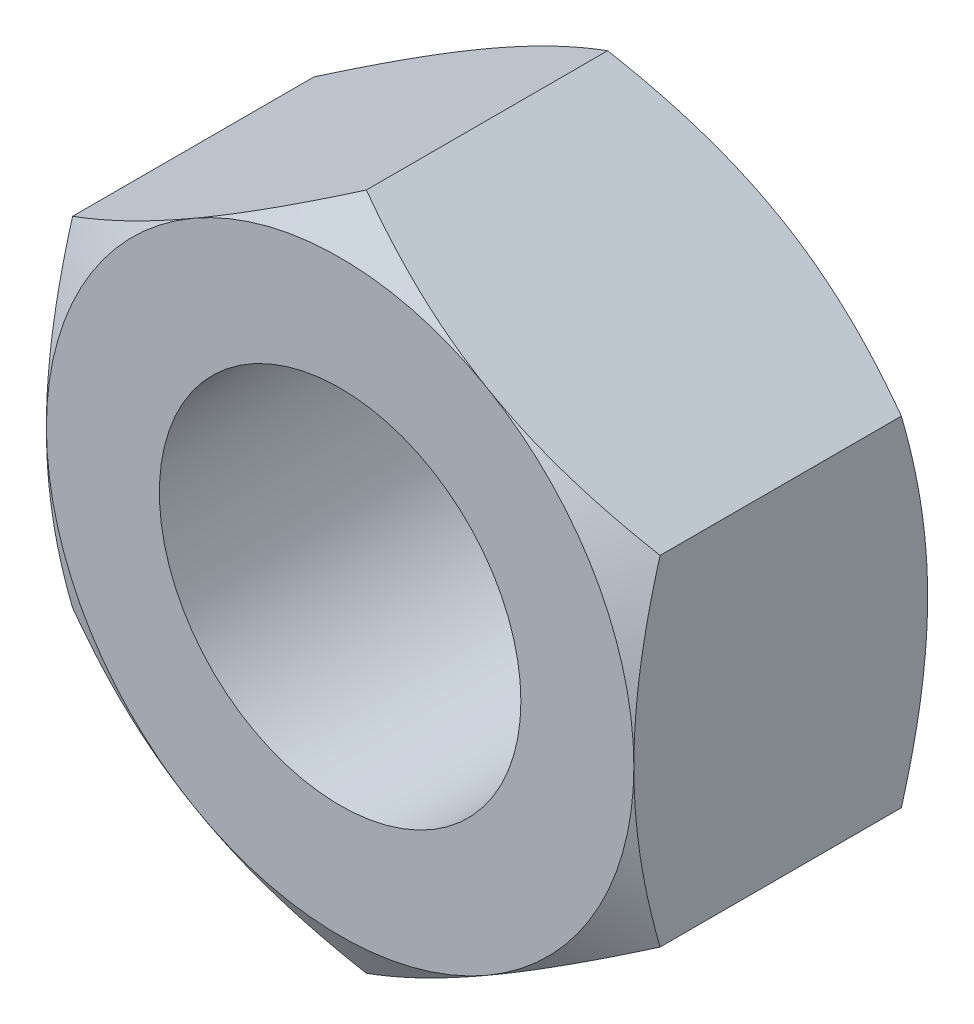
from build123d import *

# Parameters (mm, degrees)
BASE_EXTRUSION_DEPTH    = 6.5
ESQUISSE3_R             = 4
ENL_V_MAT_EXTRU_1_DEPTH = 12.867322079


with BuildPart() as part:
    # Esquisse1 → Base-Extrusion (new body)
    with BuildSketch(Plane.XY):
        Polygon((6.5, -3.75277675), (6.5, 3.75277675), (0, 7.505553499), (-6.5, 3.75277675), (-6.5, -3.75277675), (0, -7.505553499), align=None)
    extrude(amount=-BASE_EXTRUSION_DEPTH)

    # Esquisse2 → Enl_vement de mati_re-R_volution1 (revolve, cut)
    with BuildSketch(Plane(origin=(0, 0, 0), x_dir=(1, 0, 0), z_dir=(0, 1, 0)), mode=Mode.PRIVATE) as enl_vement_de_mati_re_r_volution1_sk:
        Polygon((-6.5, 0), (-13.129165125, 0), (-13.129165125, 6.5), (-6.5, 6.5), (-12.129165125, 3.25), align=None)
    revolve(enl_vement_de_mati_re_r_volution1_sk.sketch.rotate(Axis((0, 0, -6.5), (0, 0, 1)), 180), axis=Axis((0, 0, -6.5), (0, 0, 1)), mode=Mode.SUBTRACT)

    # Esquisse3 → Enl_v. mat.-Extru.1 (cut, through all)
    with BuildSketch(Plane.XY):
        Circle(ESQUISSE3_R)
    extrude(amount=-ENL_V_MAT_EXTRU_1_DEPTH, mode=Mode.SUBTRACT)


solid = part.part
